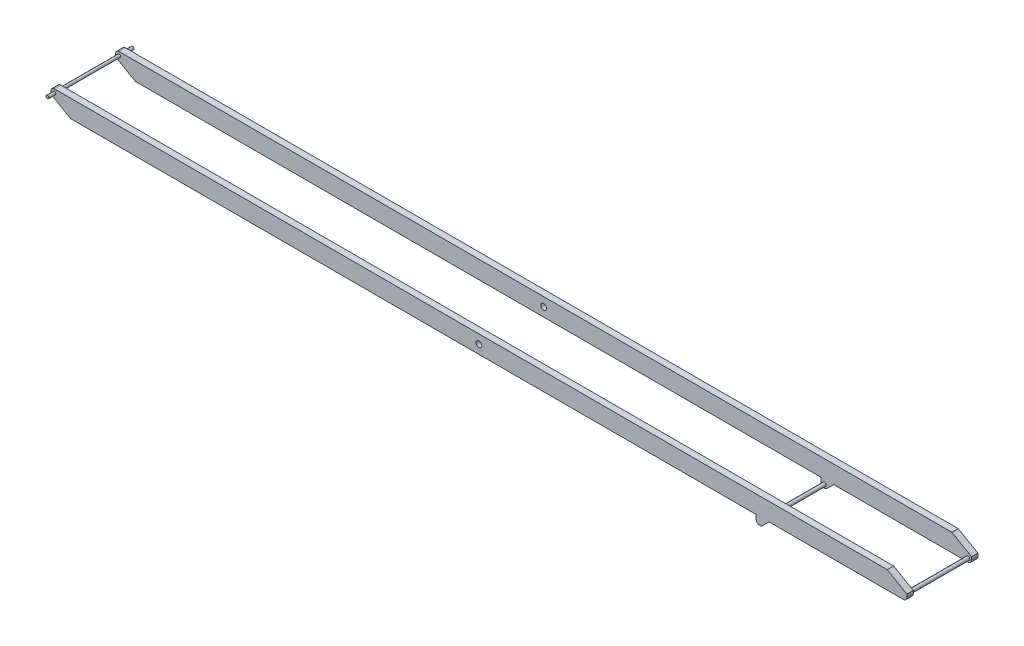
ISO-10303-21;
HEADER;
FILE_DESCRIPTION(('STEP AP214'),'2;1');
FILE_NAME('part.step','',(''),(''),'','','');
FILE_SCHEMA(('AUTOMOTIVE_DESIGN { 1 0 10303 214 1 1 1 1 }'));
ENDSEC;
DATA;
#1=APPLICATION_CONTEXT('core data for automotive mechanical design processes');
#2=APPLICATION_PROTOCOL_DEFINITION('international standard','automotive_design',2000,#1);
#3=PRODUCT_CONTEXT('',#1,'mechanical');
#4=PRODUCT('Part','Part','',(#3));
#5=PRODUCT_RELATED_PRODUCT_CATEGORY('part','',(#4));
#6=PRODUCT_DEFINITION_FORMATION('','',#4);
#7=PRODUCT_DEFINITION_CONTEXT('part definition',#1,'design');
#8=PRODUCT_DEFINITION('design','',#6,#7);
#9=PRODUCT_DEFINITION_SHAPE('','',#8);
#10=(LENGTH_UNIT() NAMED_UNIT(*) SI_UNIT(.MILLI.,.METRE.));
#11=(NAMED_UNIT(*) PLANE_ANGLE_UNIT() SI_UNIT($,.RADIAN.));
#12=(NAMED_UNIT(*) SI_UNIT($,.STERADIAN.) SOLID_ANGLE_UNIT());
#13=UNCERTAINTY_MEASURE_WITH_UNIT(LENGTH_MEASURE(1.E-05),#10,'distance_accuracy_value','');
#14=(GEOMETRIC_REPRESENTATION_CONTEXT(3) GLOBAL_UNCERTAINTY_ASSIGNED_CONTEXT((#13)) GLOBAL_UNIT_ASSIGNED_CONTEXT((#10,
#11,#12)) REPRESENTATION_CONTEXT('',''));
#15=CARTESIAN_POINT('',(0.,0.,0.));
#16=DIRECTION('',(0.,0.,1.));
#17=DIRECTION('',(1.,0.,0.));
#18=AXIS2_PLACEMENT_3D('',#15,#16,#17);
#19=CARTESIAN_POINT('',(0.,-50.,500.));
#20=DIRECTION('',(0.,1.,0.));
#21=DIRECTION('',(-1.,0.,0.));
#22=AXIS2_PLACEMENT_3D('',#19,#20,#21);
#23=PLANE('',#22);
#24=DIRECTION('',(1.,0.,0.));
#25=VECTOR('',#24,1.);
#26=CARTESIAN_POINT('',(0.,-50.,-500.));
#27=LINE('',#26,#25);
#28=CARTESIAN_POINT('',(-11722.871870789,-50.0000000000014,-500.));
#29=VERTEX_POINT('',#28);
#30=CARTESIAN_POINT('',(-2072.01013845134,-50.0000000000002,-500.));
#31=VERTEX_POINT('',#30);
#32=EDGE_CURVE('E55',#29,#31,#27,.T.);
#33=ORIENTED_EDGE('',*,*,#32,.T.);
#34=DIRECTION('',(0.,0.,-1.));
#35=VECTOR('',#34,1.);
#36=CARTESIAN_POINT('',(-2072.01013845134,-50.0000000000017,11645.376393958));
#37=LINE('',#36,#35);
#38=CARTESIAN_POINT('',(-2072.01013845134,-50.0000000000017,-410.));
#39=VERTEX_POINT('',#38);
#40=EDGE_CURVE('E230',#39,#31,#37,.T.);
#41=ORIENTED_EDGE('',*,*,#40,.F.);
#42=DIRECTION('',(-1.,0.,0.));
#43=VECTOR('',#42,1.);
#44=CARTESIAN_POINT('',(-13013.7618016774,-50.000000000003,-410.));
#45=LINE('',#44,#43);
#46=CARTESIAN_POINT('',(-11722.871870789,-50.0000000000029,-410.));
#47=VERTEX_POINT('',#46);
#48=EDGE_CURVE('E371',#39,#47,#45,.T.);
#49=ORIENTED_EDGE('',*,*,#48,.T.);
#50=DIRECTION('',(0.,0.,-1.));
#51=VECTOR('',#50,1.);
#52=CARTESIAN_POINT('',(-11722.871870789,-50.0000000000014,500.));
#53=LINE('',#52,#51);
#54=EDGE_CURVE('E399',#47,#29,#53,.T.);
#55=ORIENTED_EDGE('',*,*,#54,.T.);
#56=EDGE_LOOP('',(#33,#41,#49,#55));
#57=FACE_BOUND('',#56,.T.);
#58=ADVANCED_FACE('F31',(#57),#23,.F.);
#59=CARTESIAN_POINT('',(-2022.01013845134,-110.000000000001,500.));
#60=DIRECTION('',(0.,0.,-1.));
#61=DIRECTION('',(-1.,0.,0.));
#62=AXIS2_PLACEMENT_3D('',#59,#60,#61);
#63=CYLINDRICAL_SURFACE('',#62,25.);
#64=CARTESIAN_POINT('',(-2022.01013845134,-110.000000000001,410.));
#65=DIRECTION('',(0.,0.,1.));
#66=DIRECTION('',(1.,0.,0.));
#67=AXIS2_PLACEMENT_3D('',#64,#65,#66);
#68=CIRCLE('',#67,25.);
#69=CARTESIAN_POINT('',(-1997.01013845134,-110.000000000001,410.));
#70=VERTEX_POINT('',#69);
#71=EDGE_CURVE('E40',#70,#70,#68,.F.);
#72=ORIENTED_EDGE('',*,*,#71,.T.);
#73=EDGE_LOOP('',(#72));
#74=FACE_BOUND('',#73,.T.);
#75=CARTESIAN_POINT('',(-2022.01013845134,-110.000000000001,-410.));
#76=DIRECTION('',(0.,0.,-1.));
#77=DIRECTION('',(-1.,0.,0.));
#78=AXIS2_PLACEMENT_3D('',#75,#76,#77);
#79=CIRCLE('',#78,25.);
#80=CARTESIAN_POINT('',(-2047.01013845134,-110.000000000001,-410.));
#81=VERTEX_POINT('',#80);
#82=EDGE_CURVE('E11',#81,#81,#79,.T.);
#83=ORIENTED_EDGE('',*,*,#82,.F.);
#84=EDGE_LOOP('',(#83));
#85=FACE_BOUND('',#84,.T.);
#86=ADVANCED_FACE('F414',(#74,#85),#63,.T.);
#87=CARTESIAN_POINT('',(-13013.7618016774,-50.000000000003,410.));
#88=DIRECTION('',(0.,0.,1.));
#89=DIRECTION('',(1.,0.,0.));
#90=AXIS2_PLACEMENT_3D('',#87,#88,#89);
#91=PLANE('',#90);
#92=CARTESIAN_POINT('',(-5974.52927016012,74.9999999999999,410.));
#93=DIRECTION('',(0.,0.,1.));
#94=DIRECTION('',(1.,0.,0.));
#95=AXIS2_PLACEMENT_3D('',#92,#93,#94);
#96=CIRCLE('',#95,40.0000000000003);
#97=CARTESIAN_POINT('',(-5934.52927016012,74.9999999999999,410.));
#98=VERTEX_POINT('',#97);
#99=EDGE_CURVE('E220',#98,#98,#96,.T.);
#100=ORIENTED_EDGE('',*,*,#99,.T.);
#101=EDGE_LOOP('',(#100));
#102=FACE_BOUND('',#101,.T.);
#103=CARTESIAN_POINT('',(-11949.0585403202,149.999999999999,410.));
#104=DIRECTION('',(0.,0.,1.));
#105=DIRECTION('',(1.,0.,0.));
#106=AXIS2_PLACEMENT_3D('',#103,#104,#105);
#107=CIRCLE('',#106,19.9999999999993);
#108=CARTESIAN_POINT('',(-11929.0585403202,149.999999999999,410.));
#109=VERTEX_POINT('',#108);
#110=EDGE_CURVE('E396',#109,#109,#107,.T.);
#111=ORIENTED_EDGE('',*,*,#110,.T.);
#112=EDGE_LOOP('',(#111));
#113=FACE_BOUND('',#112,.T.);
#114=CARTESIAN_POINT('',(0.,0.,410.));
#115=DIRECTION('',(0.,0.,1.));
#116=DIRECTION('',(1.,0.,0.));
#117=AXIS2_PLACEMENT_3D('',#114,#115,#116);
#118=CIRCLE('',#117,25.);
#119=CARTESIAN_POINT('',(25.,0.,410.));
#120=VERTEX_POINT('',#119);
#121=EDGE_CURVE('E259',#120,#120,#118,.F.);
#122=ORIENTED_EDGE('',*,*,#121,.F.);
#123=EDGE_LOOP('',(#122));
#124=FACE_BOUND('',#123,.T.);
#125=DIRECTION('',(1.,0.,0.));
#126=VECTOR('',#125,1.);
#127=CARTESIAN_POINT('',(-13013.7618016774,-50.000000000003,410.));
#128=LINE('',#127,#126);
#129=CARTESIAN_POINT('',(-1890.59286257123,-50.0000000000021,410.));
#130=VERTEX_POINT('',#129);
#131=CARTESIAN_POINT('',(0.,-50.0000000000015,410.));
#132=VERTEX_POINT('',#131);
#133=EDGE_CURVE('E269',#130,#132,#128,.T.);
#134=ORIENTED_EDGE('',*,*,#133,.F.);
#135=DIRECTION('',(-0.709710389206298,-0.704493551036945,0.));
#136=VECTOR('',#135,1.);
#137=CARTESIAN_POINT('',(-1876.87589747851,-36.3838636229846,410.));
#138=LINE('',#137,#136);
#139=CARTESIAN_POINT('',(-1986.78546089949,-145.485519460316,410.));
#140=VERTEX_POINT('',#139);
#141=EDGE_CURVE('E240',#130,#140,#138,.T.);
#142=ORIENTED_EDGE('',*,*,#141,.T.);
#143=CARTESIAN_POINT('',(-2022.01013845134,-110.000000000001,410.));
#144=DIRECTION('',(0.,0.,1.));
#145=DIRECTION('',(1.,0.,0.));
#146=AXIS2_PLACEMENT_3D('',#143,#144,#145);
#147=CIRCLE('',#146,49.9999999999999);
#148=CARTESIAN_POINT('',(-2072.01013845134,-110.000000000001,410.));
#149=VERTEX_POINT('',#148);
#150=EDGE_CURVE('E237',#140,#149,#147,.F.);
#151=ORIENTED_EDGE('',*,*,#150,.T.);
#152=DIRECTION('',(0.,1.,0.));
#153=VECTOR('',#152,1.);
#154=CARTESIAN_POINT('',(-2072.01013845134,-110.000000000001,410.));
#155=LINE('',#154,#153);
#156=CARTESIAN_POINT('',(-2072.01013845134,-50.0000000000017,410.));
#157=VERTEX_POINT('',#156);
#158=EDGE_CURVE('E234',#149,#157,#155,.T.);
#159=ORIENTED_EDGE('',*,*,#158,.T.);
#160=CARTESIAN_POINT('',(-11722.871870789,-50.0000000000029,410.));
#161=VERTEX_POINT('',#160);
#162=EDGE_CURVE('E266',#161,#157,#128,.T.);
#163=ORIENTED_EDGE('',*,*,#162,.F.);
#164=DIRECTION('',(0.866025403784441,-0.499999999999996,0.));
#165=VECTOR('',#164,1.);
#166=CARTESIAN_POINT('',(-12000.,109.999999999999,410.));
#167=LINE('',#166,#165);
#168=CARTESIAN_POINT('',(-12000.,109.999999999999,410.));
#169=VERTEX_POINT('',#168);
#170=EDGE_CURVE('E279',#169,#161,#167,.T.);
#171=ORIENTED_EDGE('',*,*,#170,.F.);
#172=DIRECTION('',(0.,-1.,0.));
#173=VECTOR('',#172,1.);
#174=CARTESIAN_POINT('',(-12000.,149.999999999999,410.));
#175=LINE('',#174,#173);
#176=CARTESIAN_POINT('',(-12000.,149.999999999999,410.));
#177=VERTEX_POINT('',#176);
#178=EDGE_CURVE('E282',#177,#169,#175,.T.);
#179=ORIENTED_EDGE('',*,*,#178,.F.);
#180=CARTESIAN_POINT('',(-11950.,149.999999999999,410.));
#181=DIRECTION('',(0.,0.,1.));
#182=DIRECTION('',(1.,0.,0.));
#183=AXIS2_PLACEMENT_3D('',#180,#181,#182);
#184=CIRCLE('',#183,49.9999999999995);
#185=CARTESIAN_POINT('',(-11950.,199.999999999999,410.));
#186=VERTEX_POINT('',#185);
#187=EDGE_CURVE('E285',#186,#177,#184,.T.);
#188=ORIENTED_EDGE('',*,*,#187,.F.);
#189=DIRECTION('',(1.,0.,0.));
#190=VECTOR('',#189,1.);
#191=CARTESIAN_POINT('',(-13013.7618016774,199.999999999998,410.));
#192=LINE('',#191,#190);
#193=CARTESIAN_POINT('',(-227.128129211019,200.,410.));
#194=VERTEX_POINT('',#193);
#195=EDGE_CURVE('E265',#186,#194,#192,.T.);
#196=ORIENTED_EDGE('',*,*,#195,.T.);
#197=DIRECTION('',(-0.866025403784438,0.500000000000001,0.));
#198=VECTOR('',#197,1.);
#199=CARTESIAN_POINT('',(50.,40.,410.));
#200=LINE('',#199,#198);
#201=CARTESIAN_POINT('',(50.,40.,410.));
#202=VERTEX_POINT('',#201);
#203=EDGE_CURVE('E268',#202,#194,#200,.T.);
#204=ORIENTED_EDGE('',*,*,#203,.F.);
#205=DIRECTION('',(0.,1.,0.));
#206=VECTOR('',#205,1.);
#207=CARTESIAN_POINT('',(50.,0.,410.));
#208=LINE('',#207,#206);
#209=CARTESIAN_POINT('',(50.,0.,410.));
#210=VERTEX_POINT('',#209);
#211=EDGE_CURVE('E273',#210,#202,#208,.T.);
#212=ORIENTED_EDGE('',*,*,#211,.F.);
#213=CARTESIAN_POINT('',(0.,0.,410.));
#214=DIRECTION('',(0.,0.,1.));
#215=DIRECTION('',(1.,0.,0.));
#216=AXIS2_PLACEMENT_3D('',#213,#214,#215);
#217=CIRCLE('',#216,50.);
#218=EDGE_CURVE('E276',#132,#210,#217,.T.);
#219=ORIENTED_EDGE('',*,*,#218,.F.);
#220=EDGE_LOOP('',(#134,#142,#151,#159,#163,#171,#179,#188,#196,#204,#212,#219));
#221=FACE_BOUND('',#220,.T.);
#222=ORIENTED_EDGE('',*,*,#71,.F.);
#223=EDGE_LOOP('',(#222));
#224=FACE_BOUND('',#223,.T.);
#225=ADVANCED_FACE('F417',(#102,#113,#124,#221,#224),#91,.F.);
#226=CARTESIAN_POINT('',(0.,-50.,500.));
#227=DIRECTION('',(0.,1.,0.));
#228=DIRECTION('',(-1.,0.,0.));
#229=AXIS2_PLACEMENT_3D('',#226,#227,#228);
#230=PLANE('',#229);
#231=ORIENTED_EDGE('',*,*,#162,.T.);
#232=DIRECTION('',(0.,0.,1.));
#233=VECTOR('',#232,1.);
#234=CARTESIAN_POINT('',(-2072.01013845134,-50.0000000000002,500.));
#235=LINE('',#234,#233);
#236=CARTESIAN_POINT('',(-2072.01013845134,-50.0000000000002,500.));
#237=VERTEX_POINT('',#236);
#238=EDGE_CURVE('E257',#157,#237,#235,.T.);
#239=ORIENTED_EDGE('',*,*,#238,.T.);
#240=DIRECTION('',(1.,0.,0.));
#241=VECTOR('',#240,1.);
#242=CARTESIAN_POINT('',(0.,-50.,500.));
#243=LINE('',#242,#241);
#244=CARTESIAN_POINT('',(-11722.871870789,-50.0000000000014,500.));
#245=VERTEX_POINT('',#244);
#246=EDGE_CURVE('E299',#245,#237,#243,.T.);
#247=ORIENTED_EDGE('',*,*,#246,.F.);
#248=DIRECTION('',(0.,0.,-1.));
#249=VECTOR('',#248,1.);
#250=CARTESIAN_POINT('',(-11722.871870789,-50.0000000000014,500.));
#251=LINE('',#250,#249);
#252=EDGE_CURVE('E325',#245,#161,#251,.T.);
#253=ORIENTED_EDGE('',*,*,#252,.T.);
#254=EDGE_LOOP('',(#231,#239,#247,#253));
#255=FACE_BOUND('',#254,.T.);
#256=ADVANCED_FACE('F419',(#255),#230,.F.);
#257=CARTESIAN_POINT('',(-11949.0585403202,149.999999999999,600.));
#258=DIRECTION('',(0.,0.,-1.));
#259=DIRECTION('',(-1.,0.,0.));
#260=AXIS2_PLACEMENT_3D('',#257,#258,#259);
#261=CYLINDRICAL_SURFACE('',#260,19.9999999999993);
#262=CARTESIAN_POINT('',(-11949.0585403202,149.999999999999,-410.));
#263=DIRECTION('',(0.,0.,-1.));
#264=DIRECTION('',(-1.,0.,0.));
#265=AXIS2_PLACEMENT_3D('',#262,#263,#264);
#266=CIRCLE('',#265,19.9999999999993);
#267=CARTESIAN_POINT('',(-11969.0585403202,149.999999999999,-410.));
#268=VERTEX_POINT('',#267);
#269=EDGE_CURVE('E338',#268,#268,#266,.F.);
#270=ORIENTED_EDGE('',*,*,#269,.T.);
#271=EDGE_LOOP('',(#270));
#272=FACE_BOUND('',#271,.T.);
#273=ORIENTED_EDGE('',*,*,#110,.F.);
#274=EDGE_LOOP('',(#273));
#275=FACE_BOUND('',#274,.T.);
#276=ADVANCED_FACE('F426',(#272,#275),#261,.T.);
#277=CARTESIAN_POINT('',(-11950.,149.999999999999,500.));
#278=DIRECTION('',(0.,0.,-1.));
#279=DIRECTION('',(-1.,0.,0.));
#280=AXIS2_PLACEMENT_3D('',#277,#278,#279);
#281=CYLINDRICAL_SURFACE('',#280,49.9999999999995);
#282=DIRECTION('',(0.,0.,-1.));
#283=VECTOR('',#282,1.);
#284=CARTESIAN_POINT('',(-12000.,149.999999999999,500.));
#285=LINE('',#284,#283);
#286=CARTESIAN_POINT('',(-12000.,149.999999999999,-410.));
#287=VERTEX_POINT('',#286);
#288=CARTESIAN_POINT('',(-12000.,149.999999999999,-500.));
#289=VERTEX_POINT('',#288);
#290=EDGE_CURVE('E377',#287,#289,#285,.T.);
#291=ORIENTED_EDGE('',*,*,#290,.F.);
#292=CARTESIAN_POINT('',(-11950.,149.999999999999,-410.));
#293=DIRECTION('',(0.,0.,-1.));
#294=DIRECTION('',(-1.,0.,0.));
#295=AXIS2_PLACEMENT_3D('',#292,#293,#294);
#296=CIRCLE('',#295,49.9999999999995);
#297=CARTESIAN_POINT('',(-11950.,199.999999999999,-410.));
#298=VERTEX_POINT('',#297);
#299=EDGE_CURVE('E346',#287,#298,#296,.T.);
#300=ORIENTED_EDGE('',*,*,#299,.T.);
#301=DIRECTION('',(0.,0.,-1.));
#302=VECTOR('',#301,1.);
#303=CARTESIAN_POINT('',(-11950.,199.999999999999,500.));
#304=LINE('',#303,#302);
#305=CARTESIAN_POINT('',(-11950.,199.999999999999,-500.));
#306=VERTEX_POINT('',#305);
#307=EDGE_CURVE('E382',#298,#306,#304,.T.);
#308=ORIENTED_EDGE('',*,*,#307,.T.);
#309=CARTESIAN_POINT('',(-11950.,149.999999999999,-500.));
#310=DIRECTION('',(0.,0.,1.));
#311=DIRECTION('',(1.,0.,0.));
#312=AXIS2_PLACEMENT_3D('',#309,#310,#311);
#313=CIRCLE('',#312,49.9999999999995);
#314=EDGE_CURVE('E378',#306,#289,#313,.T.);
#315=ORIENTED_EDGE('',*,*,#314,.T.);
#316=EDGE_LOOP('',(#291,#300,#308,#315));
#317=FACE_BOUND('',#316,.T.);
#318=ADVANCED_FACE('F33',(#317),#281,.T.);
#319=CARTESIAN_POINT('',(-12000.,149.999999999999,500.));
#320=DIRECTION('',(1.,0.,0.));
#321=DIRECTION('',(0.,1.,0.));
#322=AXIS2_PLACEMENT_3D('',#319,#320,#321);
#323=PLANE('',#322);
#324=DIRECTION('',(0.,0.,-1.));
#325=VECTOR('',#324,1.);
#326=CARTESIAN_POINT('',(-12000.,109.999999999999,500.));
#327=LINE('',#326,#325);
#328=CARTESIAN_POINT('',(-12000.,109.999999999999,-410.));
#329=VERTEX_POINT('',#328);
#330=CARTESIAN_POINT('',(-12000.,109.999999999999,-500.));
#331=VERTEX_POINT('',#330);
#332=EDGE_CURVE('E372',#329,#331,#327,.T.);
#333=ORIENTED_EDGE('',*,*,#332,.F.);
#334=DIRECTION('',(0.,1.,0.));
#335=VECTOR('',#334,1.);
#336=CARTESIAN_POINT('',(-12000.,149.999999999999,-410.));
#337=LINE('',#336,#335);
#338=EDGE_CURVE('E381',#329,#287,#337,.T.);
#339=ORIENTED_EDGE('',*,*,#338,.T.);
#340=ORIENTED_EDGE('',*,*,#290,.T.);
#341=DIRECTION('',(0.,-1.,0.));
#342=VECTOR('',#341,1.);
#343=CARTESIAN_POINT('',(-12000.,149.999999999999,-500.));
#344=LINE('',#343,#342);
#345=EDGE_CURVE('E373',#289,#331,#344,.T.);
#346=ORIENTED_EDGE('',*,*,#345,.T.);
#347=EDGE_LOOP('',(#333,#339,#340,#346));
#348=FACE_BOUND('',#347,.T.);
#349=ADVANCED_FACE('F450',(#348),#323,.F.);
#350=CARTESIAN_POINT('',(-12000.,109.999999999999,500.));
#351=DIRECTION('',(0.499999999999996,0.866025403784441,0.));
#352=DIRECTION('',(-0.866025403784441,0.499999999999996,0.));
#353=AXIS2_PLACEMENT_3D('',#350,#351,#352);
#354=PLANE('',#353);
#355=ORIENTED_EDGE('',*,*,#54,.F.);
#356=DIRECTION('',(-0.866025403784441,0.499999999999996,0.));
#357=VECTOR('',#356,1.);
#358=CARTESIAN_POINT('',(-12000.,109.999999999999,-410.));
#359=LINE('',#358,#357);
#360=EDGE_CURVE('E376',#47,#329,#359,.T.);
#361=ORIENTED_EDGE('',*,*,#360,.T.);
#362=ORIENTED_EDGE('',*,*,#332,.T.);
#363=DIRECTION('',(0.866025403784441,-0.499999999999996,0.));
#364=VECTOR('',#363,1.);
#365=CARTESIAN_POINT('',(-12000.,109.999999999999,-500.));
#366=LINE('',#365,#364);
#367=EDGE_CURVE('E368',#331,#29,#366,.T.);
#368=ORIENTED_EDGE('',*,*,#367,.T.);
#369=EDGE_LOOP('',(#355,#361,#362,#368));
#370=FACE_BOUND('',#369,.T.);
#371=ADVANCED_FACE('F443',(#370),#354,.F.);
#372=CARTESIAN_POINT('',(0.,-50.0000000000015,-410.));
#373=VERTEX_POINT('',#372);
#374=CARTESIAN_POINT('',(-1890.59286257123,-50.0000000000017,-410.));
#375=VERTEX_POINT('',#374);
#376=EDGE_CURVE('E397',#373,#375,#45,.T.);
#377=ORIENTED_EDGE('',*,*,#376,.T.);
#378=DIRECTION('',(0.,0.,-1.));
#379=VECTOR('',#378,1.);
#380=CARTESIAN_POINT('',(-1890.59286257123,-50.0000000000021,11645.376393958));
#381=LINE('',#380,#379);
#382=CARTESIAN_POINT('',(-1890.59286257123,-50.0000000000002,-500.));
#383=VERTEX_POINT('',#382);
#384=EDGE_CURVE('E47',#375,#383,#381,.T.);
#385=ORIENTED_EDGE('',*,*,#384,.T.);
#386=CARTESIAN_POINT('',(0.,-50.,-500.));
#387=VERTEX_POINT('',#386);
#388=EDGE_CURVE('E219',#383,#387,#27,.T.);
#389=ORIENTED_EDGE('',*,*,#388,.T.);
#390=DIRECTION('',(0.,0.,-1.));
#391=VECTOR('',#390,1.);
#392=CARTESIAN_POINT('',(0.,-50.,500.));
#393=LINE('',#392,#391);
#394=EDGE_CURVE('E365',#373,#387,#393,.T.);
#395=ORIENTED_EDGE('',*,*,#394,.F.);
#396=EDGE_LOOP('',(#377,#385,#389,#395));
#397=FACE_BOUND('',#396,.T.);
#398=ADVANCED_FACE('F436',(#397),#23,.F.);
#399=CARTESIAN_POINT('',(0.,0.,500.));
#400=DIRECTION('',(0.,0.,-1.));
#401=DIRECTION('',(-1.,0.,0.));
#402=AXIS2_PLACEMENT_3D('',#399,#400,#401);
#403=CYLINDRICAL_SURFACE('',#402,50.);
#404=DIRECTION('',(0.,0.,-1.));
#405=VECTOR('',#404,1.);
#406=CARTESIAN_POINT('',(50.,0.,500.));
#407=LINE('',#406,#405);
#408=CARTESIAN_POINT('',(50.,0.,-410.));
#409=VERTEX_POINT('',#408);
#410=CARTESIAN_POINT('',(50.,0.,-500.));
#411=VERTEX_POINT('',#410);
#412=EDGE_CURVE('E360',#409,#411,#407,.T.);
#413=ORIENTED_EDGE('',*,*,#412,.F.);
#414=CARTESIAN_POINT('',(0.,0.,-410.));
#415=DIRECTION('',(0.,0.,-1.));
#416=DIRECTION('',(-1.,0.,0.));
#417=AXIS2_PLACEMENT_3D('',#414,#415,#416);
#418=CIRCLE('',#417,50.);
#419=EDGE_CURVE('E367',#409,#373,#418,.T.);
#420=ORIENTED_EDGE('',*,*,#419,.T.);
#421=ORIENTED_EDGE('',*,*,#394,.T.);
#422=CARTESIAN_POINT('',(0.,0.,-500.));
#423=DIRECTION('',(0.,0.,1.));
#424=DIRECTION('',(1.,0.,0.));
#425=AXIS2_PLACEMENT_3D('',#422,#423,#424);
#426=CIRCLE('',#425,50.);
#427=EDGE_CURVE('E361',#387,#411,#426,.T.);
#428=ORIENTED_EDGE('',*,*,#427,.T.);
#429=EDGE_LOOP('',(#413,#420,#421,#428));
#430=FACE_BOUND('',#429,.T.);
#431=ADVANCED_FACE('F442',(#430),#403,.T.);
#432=CARTESIAN_POINT('',(50.,0.,500.));
#433=DIRECTION('',(-1.,0.,0.));
#434=DIRECTION('',(0.,-1.,0.));
#435=AXIS2_PLACEMENT_3D('',#432,#433,#434);
#436=PLANE('',#435);
#437=DIRECTION('',(0.,0.,-1.));
#438=VECTOR('',#437,1.);
#439=CARTESIAN_POINT('',(50.,40.,500.));
#440=LINE('',#439,#438);
#441=CARTESIAN_POINT('',(50.,40.,-410.));
#442=VERTEX_POINT('',#441);
#443=CARTESIAN_POINT('',(50.,40.,-500.));
#444=VERTEX_POINT('',#443);
#445=EDGE_CURVE('E355',#442,#444,#440,.T.);
#446=ORIENTED_EDGE('',*,*,#445,.F.);
#447=DIRECTION('',(0.,-1.,0.));
#448=VECTOR('',#447,1.);
#449=CARTESIAN_POINT('',(50.,0.,-410.));
#450=LINE('',#449,#448);
#451=EDGE_CURVE('E364',#442,#409,#450,.T.);
#452=ORIENTED_EDGE('',*,*,#451,.T.);
#453=ORIENTED_EDGE('',*,*,#412,.T.);
#454=DIRECTION('',(0.,1.,0.));
#455=VECTOR('',#454,1.);
#456=CARTESIAN_POINT('',(50.,0.,-500.));
#457=LINE('',#456,#455);
#458=EDGE_CURVE('E356',#411,#444,#457,.T.);
#459=ORIENTED_EDGE('',*,*,#458,.T.);
#460=EDGE_LOOP('',(#446,#452,#453,#459));
#461=FACE_BOUND('',#460,.T.);
#462=ADVANCED_FACE('F448',(#461),#436,.F.);
#463=CARTESIAN_POINT('',(50.,40.,500.));
#464=DIRECTION('',(-0.500000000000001,-0.866025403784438,0.));
#465=DIRECTION('',(0.866025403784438,-0.500000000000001,0.));
#466=AXIS2_PLACEMENT_3D('',#463,#464,#465);
#467=PLANE('',#466);
#468=DIRECTION('',(0.,0.,-1.));
#469=VECTOR('',#468,1.);
#470=CARTESIAN_POINT('',(-227.12812921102,200.,500.));
#471=LINE('',#470,#469);
#472=CARTESIAN_POINT('',(-227.12812921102,200.,-410.));
#473=VERTEX_POINT('',#472);
#474=CARTESIAN_POINT('',(-227.12812921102,200.,-500.));
#475=VERTEX_POINT('',#474);
#476=EDGE_CURVE('E351',#473,#475,#471,.T.);
#477=ORIENTED_EDGE('',*,*,#476,.F.);
#478=DIRECTION('',(0.866025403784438,-0.500000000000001,0.));
#479=VECTOR('',#478,1.);
#480=CARTESIAN_POINT('',(50.,40.,-410.));
#481=LINE('',#480,#479);
#482=EDGE_CURVE('E359',#473,#442,#481,.T.);
#483=ORIENTED_EDGE('',*,*,#482,.T.);
#484=ORIENTED_EDGE('',*,*,#445,.T.);
#485=DIRECTION('',(-0.866025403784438,0.500000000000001,0.));
#486=VECTOR('',#485,1.);
#487=CARTESIAN_POINT('',(50.,40.,-500.));
#488=LINE('',#487,#486);
#489=EDGE_CURVE('E352',#444,#475,#488,.T.);
#490=ORIENTED_EDGE('',*,*,#489,.T.);
#491=EDGE_LOOP('',(#477,#483,#484,#490));
#492=FACE_BOUND('',#491,.T.);
#493=ADVANCED_FACE('F557',(#492),#467,.F.);
#494=CARTESIAN_POINT('',(-227.12812921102,200.,500.));
#495=DIRECTION('',(0.,-1.,0.));
#496=DIRECTION('',(1.,0.,0.));
#497=AXIS2_PLACEMENT_3D('',#494,#495,#496);
#498=PLANE('',#497);
#499=ORIENTED_EDGE('',*,*,#307,.F.);
#500=DIRECTION('',(-1.,0.,0.));
#501=VECTOR('',#500,1.);
#502=CARTESIAN_POINT('',(-13013.7618016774,199.999999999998,-410.));
#503=LINE('',#502,#501);
#504=EDGE_CURVE('E350',#473,#298,#503,.T.);
#505=ORIENTED_EDGE('',*,*,#504,.F.);
#506=ORIENTED_EDGE('',*,*,#476,.T.);
#507=DIRECTION('',(-1.,0.,0.));
#508=VECTOR('',#507,1.);
#509=CARTESIAN_POINT('',(-227.12812921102,200.,-500.));
#510=LINE('',#509,#508);
#511=EDGE_CURVE('E347',#475,#306,#510,.T.);
#512=ORIENTED_EDGE('',*,*,#511,.T.);
#513=EDGE_LOOP('',(#499,#505,#506,#512));
#514=FACE_BOUND('',#513,.T.);
#515=ADVANCED_FACE('F551',(#514),#498,.F.);
#516=CARTESIAN_POINT('',(-11950.,149.999999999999,-500.));
#517=DIRECTION('',(0.,0.,1.));
#518=DIRECTION('',(1.,0.,0.));
#519=AXIS2_PLACEMENT_3D('',#516,#517,#518);
#520=PLANE('',#519);
#521=CARTESIAN_POINT('',(-5974.52927016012,74.9999999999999,-500.));
#522=DIRECTION('',(0.,0.,1.));
#523=DIRECTION('',(1.,0.,0.));
#524=AXIS2_PLACEMENT_3D('',#521,#522,#523);
#525=CIRCLE('',#524,40.0000000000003);
#526=CARTESIAN_POINT('',(-5934.52927016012,74.9999999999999,-500.));
#527=VERTEX_POINT('',#526);
#528=EDGE_CURVE('E223',#527,#527,#525,.T.);
#529=ORIENTED_EDGE('',*,*,#528,.T.);
#530=EDGE_LOOP('',(#529));
#531=FACE_BOUND('',#530,.T.);
#532=ORIENTED_EDGE('',*,*,#314,.F.);
#533=ORIENTED_EDGE('',*,*,#511,.F.);
#534=ORIENTED_EDGE('',*,*,#489,.F.);
#535=ORIENTED_EDGE('',*,*,#458,.F.);
#536=ORIENTED_EDGE('',*,*,#427,.F.);
#537=ORIENTED_EDGE('',*,*,#388,.F.);
#538=DIRECTION('',(-0.709710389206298,-0.704493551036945,0.));
#539=VECTOR('',#538,1.);
#540=CARTESIAN_POINT('',(-1890.59286257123,-50.0000000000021,-500.));
#541=LINE('',#540,#539);
#542=CARTESIAN_POINT('',(-1986.78546089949,-145.485519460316,-500.));
#543=VERTEX_POINT('',#542);
#544=EDGE_CURVE('E199',#383,#543,#541,.T.);
#545=ORIENTED_EDGE('',*,*,#544,.T.);
#546=CARTESIAN_POINT('',(-2022.01013845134,-110.000000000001,-500.));
#547=DIRECTION('',(0.,0.,-1.));
#548=DIRECTION('',(-1.,0.,0.));
#549=AXIS2_PLACEMENT_3D('',#546,#547,#548);
#550=CIRCLE('',#549,49.9999999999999);
#551=CARTESIAN_POINT('',(-2072.01013845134,-110.000000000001,-500.));
#552=VERTEX_POINT('',#551);
#553=EDGE_CURVE('E207',#543,#552,#550,.T.);
#554=ORIENTED_EDGE('',*,*,#553,.T.);
#555=DIRECTION('',(0.,1.,0.));
#556=VECTOR('',#555,1.);
#557=CARTESIAN_POINT('',(-2072.01013845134,-110.000000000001,-500.));
#558=LINE('',#557,#556);
#559=EDGE_CURVE('E213',#552,#31,#558,.T.);
#560=ORIENTED_EDGE('',*,*,#559,.T.);
#561=ORIENTED_EDGE('',*,*,#32,.F.);
#562=ORIENTED_EDGE('',*,*,#367,.F.);
#563=ORIENTED_EDGE('',*,*,#345,.F.);
#564=EDGE_LOOP('',(#532,#533,#534,#535,#536,#537,#545,#554,#560,#561,#562,#563));
#565=FACE_BOUND('',#564,.T.);
#566=CARTESIAN_POINT('',(-11949.0585403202,149.999999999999,-500.));
#567=DIRECTION('',(0.,0.,1.));
#568=DIRECTION('',(1.,0.,0.));
#569=AXIS2_PLACEMENT_3D('',#566,#567,#568);
#570=CIRCLE('',#569,19.9999999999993);
#571=CARTESIAN_POINT('',(-11929.0585403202,149.999999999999,-500.));
#572=VERTEX_POINT('',#571);
#573=EDGE_CURVE('E343',#572,#572,#570,.F.);
#574=ORIENTED_EDGE('',*,*,#573,.F.);
#575=EDGE_LOOP('',(#574));
#576=FACE_BOUND('',#575,.T.);
#577=ADVANCED_FACE('F216',(#531,#565,#576),#520,.F.);
#578=CARTESIAN_POINT('',(-13013.7618016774,-50.000000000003,-410.));
#579=DIRECTION('',(0.,0.,-1.));
#580=DIRECTION('',(-1.,0.,0.));
#581=AXIS2_PLACEMENT_3D('',#578,#579,#580);
#582=PLANE('',#581);
#583=CARTESIAN_POINT('',(-5974.52927016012,74.9999999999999,-410.));
#584=DIRECTION('',(0.,0.,-1.));
#585=DIRECTION('',(-1.,0.,0.));
#586=AXIS2_PLACEMENT_3D('',#583,#584,#585);
#587=CIRCLE('',#586,40.0000000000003);
#588=CARTESIAN_POINT('',(-6014.52927016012,74.9999999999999,-410.));
#589=VERTEX_POINT('',#588);
#590=EDGE_CURVE('E461',#589,#589,#587,.T.);
#591=ORIENTED_EDGE('',*,*,#590,.T.);
#592=EDGE_LOOP('',(#591));
#593=FACE_BOUND('',#592,.T.);
#594=CARTESIAN_POINT('',(0.,0.,-410.));
#595=DIRECTION('',(0.,0.,-1.));
#596=DIRECTION('',(-1.,0.,0.));
#597=AXIS2_PLACEMENT_3D('',#594,#595,#596);
#598=CIRCLE('',#597,25.);
#599=CARTESIAN_POINT('',(-25.,0.,-410.));
#600=VERTEX_POINT('',#599);
#601=EDGE_CURVE('E262',#600,#600,#598,.F.);
#602=ORIENTED_EDGE('',*,*,#601,.F.);
#603=EDGE_LOOP('',(#602));
#604=FACE_BOUND('',#603,.T.);
#605=ORIENTED_EDGE('',*,*,#269,.F.);
#606=EDGE_LOOP('',(#605));
#607=FACE_BOUND('',#606,.T.);
#608=ORIENTED_EDGE('',*,*,#338,.F.);
#609=ORIENTED_EDGE('',*,*,#360,.F.);
#610=ORIENTED_EDGE('',*,*,#48,.F.);
#611=DIRECTION('',(0.,-1.,0.));
#612=VECTOR('',#611,1.);
#613=CARTESIAN_POINT('',(-2072.01013845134,-110.000000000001,-410.));
#614=LINE('',#613,#612);
#615=CARTESIAN_POINT('',(-2072.01013845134,-110.000000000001,-410.));
#616=VERTEX_POINT('',#615);
#617=EDGE_CURVE('E226',#39,#616,#614,.T.);
#618=ORIENTED_EDGE('',*,*,#617,.T.);
#619=CARTESIAN_POINT('',(-2022.01013845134,-110.000000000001,-410.));
#620=DIRECTION('',(0.,0.,-1.));
#621=DIRECTION('',(-1.,0.,0.));
#622=AXIS2_PLACEMENT_3D('',#619,#620,#621);
#623=CIRCLE('',#622,49.9999999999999);
#624=CARTESIAN_POINT('',(-1986.78546089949,-145.485519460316,-410.));
#625=VERTEX_POINT('',#624);
#626=EDGE_CURVE('E456',#616,#625,#623,.F.);
#627=ORIENTED_EDGE('',*,*,#626,.T.);
#628=DIRECTION('',(0.709710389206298,0.704493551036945,0.));
#629=VECTOR('',#628,1.);
#630=CARTESIAN_POINT('',(-1890.59286257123,-50.0000000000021,-410.));
#631=LINE('',#630,#629);
#632=EDGE_CURVE('E201',#625,#375,#631,.T.);
#633=ORIENTED_EDGE('',*,*,#632,.T.);
#634=ORIENTED_EDGE('',*,*,#376,.F.);
#635=ORIENTED_EDGE('',*,*,#419,.F.);
#636=ORIENTED_EDGE('',*,*,#451,.F.);
#637=ORIENTED_EDGE('',*,*,#482,.F.);
#638=ORIENTED_EDGE('',*,*,#504,.T.);
#639=ORIENTED_EDGE('',*,*,#299,.F.);
#640=EDGE_LOOP('',(#608,#609,#610,#618,#627,#633,#634,#635,#636,#637,#638,#639));
#641=FACE_BOUND('',#640,.T.);
#642=ORIENTED_EDGE('',*,*,#82,.T.);
#643=EDGE_LOOP('',(#642));
#644=FACE_BOUND('',#643,.T.);
#645=ADVANCED_FACE('F454',(#593,#604,#607,#641,#644),#582,.F.);
#646=CARTESIAN_POINT('',(-11949.0585403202,149.999999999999,-600.));
#647=DIRECTION('',(0.,0.,1.));
#648=DIRECTION('',(1.,0.,0.));
#649=AXIS2_PLACEMENT_3D('',#646,#647,#648);
#650=CIRCLE('',#649,19.9999999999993);
#651=CARTESIAN_POINT('',(-11929.0585403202,149.999999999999,-600.));
#652=VERTEX_POINT('',#651);
#653=EDGE_CURVE('E334',#652,#652,#650,.T.);
#654=ORIENTED_EDGE('',*,*,#653,.T.);
#655=EDGE_LOOP('',(#654));
#656=FACE_BOUND('',#655,.T.);
#657=ORIENTED_EDGE('',*,*,#573,.T.);
#658=EDGE_LOOP('',(#657));
#659=FACE_BOUND('',#658,.T.);
#660=ADVANCED_FACE('F544',(#656,#659),#261,.T.);
#661=CARTESIAN_POINT('',(-11949.0585403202,149.999999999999,-600.));
#662=DIRECTION('',(0.,0.,1.));
#663=DIRECTION('',(1.,0.,0.));
#664=AXIS2_PLACEMENT_3D('',#661,#662,#663);
#665=PLANE('',#664);
#666=ORIENTED_EDGE('',*,*,#653,.F.);
#667=EDGE_LOOP('',(#666));
#668=FACE_BOUND('',#667,.T.);
#669=ADVANCED_FACE('F541',(#668),#665,.F.);
#670=CARTESIAN_POINT('',(-227.12812921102,200.,500.));
#671=DIRECTION('',(0.,-1.,0.));
#672=DIRECTION('',(1.,0.,0.));
#673=AXIS2_PLACEMENT_3D('',#670,#671,#672);
#674=PLANE('',#673);
#675=DIRECTION('',(0.,0.,-1.));
#676=VECTOR('',#675,1.);
#677=CARTESIAN_POINT('',(-227.12812921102,200.,500.));
#678=LINE('',#677,#676);
#679=CARTESIAN_POINT('',(-227.12812921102,200.,500.));
#680=VERTEX_POINT('',#679);
#681=EDGE_CURVE('E313',#680,#194,#678,.T.);
#682=ORIENTED_EDGE('',*,*,#681,.T.);
#683=ORIENTED_EDGE('',*,*,#195,.F.);
#684=DIRECTION('',(0.,0.,-1.));
#685=VECTOR('',#684,1.);
#686=CARTESIAN_POINT('',(-11950.,199.999999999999,500.));
#687=LINE('',#686,#685);
#688=CARTESIAN_POINT('',(-11950.,199.999999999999,500.));
#689=VERTEX_POINT('',#688);
#690=EDGE_CURVE('E310',#689,#186,#687,.T.);
#691=ORIENTED_EDGE('',*,*,#690,.F.);
#692=DIRECTION('',(-1.,0.,0.));
#693=VECTOR('',#692,1.);
#694=CARTESIAN_POINT('',(-227.12812921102,200.,500.));
#695=LINE('',#694,#693);
#696=EDGE_CURVE('E308',#680,#689,#695,.T.);
#697=ORIENTED_EDGE('',*,*,#696,.F.);
#698=EDGE_LOOP('',(#682,#683,#691,#697));
#699=FACE_BOUND('',#698,.T.);
#700=ADVANCED_FACE('F516',(#699),#674,.F.);
#701=CARTESIAN_POINT('',(50.,40.,500.));
#702=DIRECTION('',(-0.500000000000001,-0.866025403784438,0.));
#703=DIRECTION('',(0.866025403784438,-0.500000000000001,0.));
#704=AXIS2_PLACEMENT_3D('',#701,#702,#703);
#705=PLANE('',#704);
#706=DIRECTION('',(0.,0.,-1.));
#707=VECTOR('',#706,1.);
#708=CARTESIAN_POINT('',(50.,40.,500.));
#709=LINE('',#708,#707);
#710=CARTESIAN_POINT('',(50.,40.,500.));
#711=VERTEX_POINT('',#710);
#712=EDGE_CURVE('E316',#711,#202,#709,.T.);
#713=ORIENTED_EDGE('',*,*,#712,.T.);
#714=ORIENTED_EDGE('',*,*,#203,.T.);
#715=ORIENTED_EDGE('',*,*,#681,.F.);
#716=DIRECTION('',(-0.866025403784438,0.500000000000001,0.));
#717=VECTOR('',#716,1.);
#718=CARTESIAN_POINT('',(50.,40.,500.));
#719=LINE('',#718,#717);
#720=EDGE_CURVE('E306',#711,#680,#719,.T.);
#721=ORIENTED_EDGE('',*,*,#720,.F.);
#722=EDGE_LOOP('',(#713,#714,#715,#721));
#723=FACE_BOUND('',#722,.T.);
#724=ADVANCED_FACE('F511',(#723),#705,.F.);
#725=CARTESIAN_POINT('',(50.,0.,500.));
#726=DIRECTION('',(-1.,0.,0.));
#727=DIRECTION('',(0.,-1.,0.));
#728=AXIS2_PLACEMENT_3D('',#725,#726,#727);
#729=PLANE('',#728);
#730=DIRECTION('',(0.,0.,-1.));
#731=VECTOR('',#730,1.);
#732=CARTESIAN_POINT('',(50.,0.,500.));
#733=LINE('',#732,#731);
#734=CARTESIAN_POINT('',(50.,0.,500.));
#735=VERTEX_POINT('',#734);
#736=EDGE_CURVE('E319',#735,#210,#733,.T.);
#737=ORIENTED_EDGE('',*,*,#736,.T.);
#738=ORIENTED_EDGE('',*,*,#211,.T.);
#739=ORIENTED_EDGE('',*,*,#712,.F.);
#740=DIRECTION('',(0.,1.,0.));
#741=VECTOR('',#740,1.);
#742=CARTESIAN_POINT('',(50.,0.,500.));
#743=LINE('',#742,#741);
#744=EDGE_CURVE('E304',#735,#711,#743,.T.);
#745=ORIENTED_EDGE('',*,*,#744,.F.);
#746=EDGE_LOOP('',(#737,#738,#739,#745));
#747=FACE_BOUND('',#746,.T.);
#748=ADVANCED_FACE('F509',(#747),#729,.F.);
#749=CARTESIAN_POINT('',(0.,0.,500.));
#750=DIRECTION('',(0.,0.,-1.));
#751=DIRECTION('',(-1.,0.,0.));
#752=AXIS2_PLACEMENT_3D('',#749,#750,#751);
#753=CYLINDRICAL_SURFACE('',#752,50.);
#754=DIRECTION('',(0.,0.,-1.));
#755=VECTOR('',#754,1.);
#756=CARTESIAN_POINT('',(0.,-50.,500.));
#757=LINE('',#756,#755);
#758=CARTESIAN_POINT('',(0.,-50.,500.));
#759=VERTEX_POINT('',#758);
#760=EDGE_CURVE('E322',#759,#132,#757,.T.);
#761=ORIENTED_EDGE('',*,*,#760,.T.);
#762=ORIENTED_EDGE('',*,*,#218,.T.);
#763=ORIENTED_EDGE('',*,*,#736,.F.);
#764=CARTESIAN_POINT('',(0.,0.,500.));
#765=DIRECTION('',(0.,0.,1.));
#766=DIRECTION('',(1.,0.,0.));
#767=AXIS2_PLACEMENT_3D('',#764,#765,#766);
#768=CIRCLE('',#767,50.);
#769=EDGE_CURVE('E302',#759,#735,#768,.T.);
#770=ORIENTED_EDGE('',*,*,#769,.F.);
#771=EDGE_LOOP('',(#761,#762,#763,#770));
#772=FACE_BOUND('',#771,.T.);
#773=ADVANCED_FACE('F503',(#772),#753,.T.);
#774=CARTESIAN_POINT('',(-1890.59286257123,-50.0000000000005,500.));
#775=VERTEX_POINT('',#774);
#776=EDGE_CURVE('E298',#775,#759,#243,.T.);
#777=ORIENTED_EDGE('',*,*,#776,.F.);
#778=DIRECTION('',(0.,0.,-1.));
#779=VECTOR('',#778,1.);
#780=CARTESIAN_POINT('',(-1890.59286257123,-50.0000000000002,500.));
#781=LINE('',#780,#779);
#782=EDGE_CURVE('E254',#775,#130,#781,.T.);
#783=ORIENTED_EDGE('',*,*,#782,.T.);
#784=ORIENTED_EDGE('',*,*,#133,.T.);
#785=ORIENTED_EDGE('',*,*,#760,.F.);
#786=EDGE_LOOP('',(#777,#783,#784,#785));
#787=FACE_BOUND('',#786,.T.);
#788=ADVANCED_FACE('F429',(#787),#230,.F.);
#789=CARTESIAN_POINT('',(-12000.,109.999999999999,500.));
#790=DIRECTION('',(0.499999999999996,0.866025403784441,0.));
#791=DIRECTION('',(-0.866025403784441,0.499999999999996,0.));
#792=AXIS2_PLACEMENT_3D('',#789,#790,#791);
#793=PLANE('',#792);
#794=DIRECTION('',(0.,0.,-1.));
#795=VECTOR('',#794,1.);
#796=CARTESIAN_POINT('',(-12000.,109.999999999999,500.));
#797=LINE('',#796,#795);
#798=CARTESIAN_POINT('',(-12000.,109.999999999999,500.));
#799=VERTEX_POINT('',#798);
#800=EDGE_CURVE('E328',#799,#169,#797,.T.);
#801=ORIENTED_EDGE('',*,*,#800,.T.);
#802=ORIENTED_EDGE('',*,*,#170,.T.);
#803=ORIENTED_EDGE('',*,*,#252,.F.);
#804=DIRECTION('',(0.866025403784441,-0.499999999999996,0.));
#805=VECTOR('',#804,1.);
#806=CARTESIAN_POINT('',(-12000.,109.999999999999,500.));
#807=LINE('',#806,#805);
#808=EDGE_CURVE('E296',#799,#245,#807,.T.);
#809=ORIENTED_EDGE('',*,*,#808,.F.);
#810=EDGE_LOOP('',(#801,#802,#803,#809));
#811=FACE_BOUND('',#810,.T.);
#812=ADVANCED_FACE('F524',(#811),#793,.F.);
#813=CARTESIAN_POINT('',(-12000.,149.999999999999,500.));
#814=DIRECTION('',(1.,0.,0.));
#815=DIRECTION('',(0.,1.,0.));
#816=AXIS2_PLACEMENT_3D('',#813,#814,#815);
#817=PLANE('',#816);
#818=DIRECTION('',(0.,0.,-1.));
#819=VECTOR('',#818,1.);
#820=CARTESIAN_POINT('',(-12000.,149.999999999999,500.));
#821=LINE('',#820,#819);
#822=CARTESIAN_POINT('',(-12000.,149.999999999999,500.));
#823=VERTEX_POINT('',#822);
#824=EDGE_CURVE('E331',#823,#177,#821,.T.);
#825=ORIENTED_EDGE('',*,*,#824,.T.);
#826=ORIENTED_EDGE('',*,*,#178,.T.);
#827=ORIENTED_EDGE('',*,*,#800,.F.);
#828=DIRECTION('',(0.,-1.,0.));
#829=VECTOR('',#828,1.);
#830=CARTESIAN_POINT('',(-12000.,149.999999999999,500.));
#831=LINE('',#830,#829);
#832=EDGE_CURVE('E294',#823,#799,#831,.T.);
#833=ORIENTED_EDGE('',*,*,#832,.F.);
#834=EDGE_LOOP('',(#825,#826,#827,#833));
#835=FACE_BOUND('',#834,.T.);
#836=ADVANCED_FACE('F522',(#835),#817,.F.);
#837=CARTESIAN_POINT('',(-11950.,149.999999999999,500.));
#838=DIRECTION('',(0.,0.,-1.));
#839=DIRECTION('',(-1.,0.,0.));
#840=AXIS2_PLACEMENT_3D('',#837,#838,#839);
#841=CYLINDRICAL_SURFACE('',#840,49.9999999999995);
#842=ORIENTED_EDGE('',*,*,#690,.T.);
#843=ORIENTED_EDGE('',*,*,#187,.T.);
#844=ORIENTED_EDGE('',*,*,#824,.F.);
#845=CARTESIAN_POINT('',(-11950.,149.999999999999,500.));
#846=DIRECTION('',(0.,0.,1.));
#847=DIRECTION('',(1.,0.,0.));
#848=AXIS2_PLACEMENT_3D('',#845,#846,#847);
#849=CIRCLE('',#848,49.9999999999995);
#850=EDGE_CURVE('E291',#689,#823,#849,.T.);
#851=ORIENTED_EDGE('',*,*,#850,.F.);
#852=EDGE_LOOP('',(#842,#843,#844,#851));
#853=FACE_BOUND('',#852,.T.);
#854=ADVANCED_FACE('F475',(#853),#841,.T.);
#855=CARTESIAN_POINT('',(-11950.,149.999999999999,500.));
#856=DIRECTION('',(0.,0.,1.));
#857=DIRECTION('',(1.,0.,0.));
#858=AXIS2_PLACEMENT_3D('',#855,#856,#857);
#859=PLANE('',#858);
#860=CARTESIAN_POINT('',(-5974.52927016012,74.9999999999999,500.));
#861=DIRECTION('',(0.,0.,1.));
#862=DIRECTION('',(1.,0.,0.));
#863=AXIS2_PLACEMENT_3D('',#860,#861,#862);
#864=CIRCLE('',#863,40.0000000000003);
#865=CARTESIAN_POINT('',(-5934.52927016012,74.9999999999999,500.));
#866=VERTEX_POINT('',#865);
#867=EDGE_CURVE('E35',#866,#866,#864,.T.);
#868=ORIENTED_EDGE('',*,*,#867,.F.);
#869=EDGE_LOOP('',(#868));
#870=FACE_BOUND('',#869,.T.);
#871=CARTESIAN_POINT('',(-11949.0585403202,149.999999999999,500.));
#872=DIRECTION('',(0.,0.,1.));
#873=DIRECTION('',(1.,0.,0.));
#874=AXIS2_PLACEMENT_3D('',#871,#872,#873);
#875=CIRCLE('',#874,19.9999999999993);
#876=CARTESIAN_POINT('',(-11929.0585403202,149.999999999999,500.));
#877=VERTEX_POINT('',#876);
#878=EDGE_CURVE('E288',#877,#877,#875,.T.);
#879=ORIENTED_EDGE('',*,*,#878,.F.);
#880=EDGE_LOOP('',(#879));
#881=FACE_BOUND('',#880,.T.);
#882=ORIENTED_EDGE('',*,*,#246,.T.);
#883=DIRECTION('',(0.,-1.,0.));
#884=VECTOR('',#883,1.);
#885=CARTESIAN_POINT('',(-2072.01013845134,-110.000000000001,500.));
#886=LINE('',#885,#884);
#887=CARTESIAN_POINT('',(-2072.01013845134,-110.000000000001,500.));
#888=VERTEX_POINT('',#887);
#889=EDGE_CURVE('E247',#237,#888,#886,.T.);
#890=ORIENTED_EDGE('',*,*,#889,.T.);
#891=CARTESIAN_POINT('',(-2022.01013845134,-110.000000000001,500.));
#892=DIRECTION('',(0.,0.,1.));
#893=DIRECTION('',(1.,0.,0.));
#894=AXIS2_PLACEMENT_3D('',#891,#892,#893);
#895=CIRCLE('',#894,49.9999999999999);
#896=CARTESIAN_POINT('',(-1986.78546089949,-145.485519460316,500.));
#897=VERTEX_POINT('',#896);
#898=EDGE_CURVE('E241',#888,#897,#895,.T.);
#899=ORIENTED_EDGE('',*,*,#898,.T.);
#900=DIRECTION('',(0.709710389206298,0.704493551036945,0.));
#901=VECTOR('',#900,1.);
#902=CARTESIAN_POINT('',(-1876.87589747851,-36.3838636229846,500.));
#903=LINE('',#902,#901);
#904=EDGE_CURVE('E244',#897,#775,#903,.T.);
#905=ORIENTED_EDGE('',*,*,#904,.T.);
#906=ORIENTED_EDGE('',*,*,#776,.T.);
#907=ORIENTED_EDGE('',*,*,#769,.T.);
#908=ORIENTED_EDGE('',*,*,#744,.T.);
#909=ORIENTED_EDGE('',*,*,#720,.T.);
#910=ORIENTED_EDGE('',*,*,#696,.T.);
#911=ORIENTED_EDGE('',*,*,#850,.T.);
#912=ORIENTED_EDGE('',*,*,#832,.T.);
#913=ORIENTED_EDGE('',*,*,#808,.T.);
#914=EDGE_LOOP('',(#882,#890,#899,#905,#906,#907,#908,#909,#910,#911,#912,#913));
#915=FACE_BOUND('',#914,.T.);
#916=ADVANCED_FACE('F471',(#870,#881,#915),#859,.T.);
#917=CARTESIAN_POINT('',(-11949.0585403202,149.999999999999,600.));
#918=DIRECTION('',(0.,0.,1.));
#919=DIRECTION('',(1.,0.,0.));
#920=AXIS2_PLACEMENT_3D('',#917,#918,#919);
#921=PLANE('',#920);
#922=CARTESIAN_POINT('',(-11949.0585403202,149.999999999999,600.));
#923=DIRECTION('',(0.,0.,1.));
#924=DIRECTION('',(1.,0.,0.));
#925=AXIS2_PLACEMENT_3D('',#922,#923,#924);
#926=CIRCLE('',#925,19.9999999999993);
#927=CARTESIAN_POINT('',(-11929.0585403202,149.999999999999,600.));
#928=VERTEX_POINT('',#927);
#929=EDGE_CURVE('E335',#928,#928,#926,.T.);
#930=ORIENTED_EDGE('',*,*,#929,.T.);
#931=EDGE_LOOP('',(#930));
#932=FACE_BOUND('',#931,.T.);
#933=ADVANCED_FACE('F474',(#932),#921,.T.);
#934=ORIENTED_EDGE('',*,*,#878,.T.);
#935=EDGE_LOOP('',(#934));
#936=FACE_BOUND('',#935,.T.);
#937=ORIENTED_EDGE('',*,*,#929,.F.);
#938=EDGE_LOOP('',(#937));
#939=FACE_BOUND('',#938,.T.);
#940=ADVANCED_FACE('F539',(#936,#939),#261,.T.);
#941=CARTESIAN_POINT('',(0.,0.,500.));
#942=DIRECTION('',(0.,0.,-1.));
#943=DIRECTION('',(-1.,0.,0.));
#944=AXIS2_PLACEMENT_3D('',#941,#942,#943);
#945=CYLINDRICAL_SURFACE('',#944,25.);
#946=ORIENTED_EDGE('',*,*,#121,.T.);
#947=EDGE_LOOP('',(#946));
#948=FACE_BOUND('',#947,.T.);
#949=ORIENTED_EDGE('',*,*,#601,.T.);
#950=EDGE_LOOP('',(#949));
#951=FACE_BOUND('',#950,.T.);
#952=ADVANCED_FACE('F599',(#948,#951),#945,.T.);
#953=CARTESIAN_POINT('',(-2072.01013845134,-110.000000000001,179.0057984));
#954=DIRECTION('',(-1.,0.,0.));
#955=DIRECTION('',(0.,0.,1.));
#956=AXIS2_PLACEMENT_3D('',#953,#954,#955);
#957=PLANE('',#956);
#958=ORIENTED_EDGE('',*,*,#238,.F.);
#959=ORIENTED_EDGE('',*,*,#158,.F.);
#960=DIRECTION('',(0.,0.,1.));
#961=VECTOR('',#960,1.);
#962=CARTESIAN_POINT('',(-2072.01013845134,-110.000000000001,179.0057984));
#963=LINE('',#962,#961);
#964=EDGE_CURVE('E238',#149,#888,#963,.T.);
#965=ORIENTED_EDGE('',*,*,#964,.T.);
#966=ORIENTED_EDGE('',*,*,#889,.F.);
#967=EDGE_LOOP('',(#958,#959,#965,#966));
#968=FACE_BOUND('',#967,.T.);
#969=ADVANCED_FACE('F484',(#968),#957,.T.);
#970=CARTESIAN_POINT('',(-1876.87589747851,-36.3838636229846,179.0057984));
#971=DIRECTION('',(0.704493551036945,-0.709710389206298,0.));
#972=DIRECTION('',(0.709710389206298,0.704493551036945,0.));
#973=AXIS2_PLACEMENT_3D('',#970,#971,#972);
#974=PLANE('',#973);
#975=ORIENTED_EDGE('',*,*,#782,.F.);
#976=ORIENTED_EDGE('',*,*,#904,.F.);
#977=DIRECTION('',(0.,0.,1.));
#978=VECTOR('',#977,1.);
#979=CARTESIAN_POINT('',(-1986.78546089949,-145.485519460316,179.0057984));
#980=LINE('',#979,#978);
#981=EDGE_CURVE('E249',#140,#897,#980,.T.);
#982=ORIENTED_EDGE('',*,*,#981,.F.);
#983=ORIENTED_EDGE('',*,*,#141,.F.);
#984=EDGE_LOOP('',(#975,#976,#982,#983));
#985=FACE_BOUND('',#984,.T.);
#986=ADVANCED_FACE('F496',(#985),#974,.T.);
#987=CARTESIAN_POINT('',(-2022.01013845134,-110.000000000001,179.0057984));
#988=DIRECTION('',(0.,0.,1.));
#989=DIRECTION('',(1.,0.,0.));
#990=AXIS2_PLACEMENT_3D('',#987,#988,#989);
#991=CYLINDRICAL_SURFACE('',#990,49.9999999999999);
#992=ORIENTED_EDGE('',*,*,#150,.F.);
#993=ORIENTED_EDGE('',*,*,#981,.T.);
#994=ORIENTED_EDGE('',*,*,#898,.F.);
#995=ORIENTED_EDGE('',*,*,#964,.F.);
#996=EDGE_LOOP('',(#992,#993,#994,#995));
#997=FACE_BOUND('',#996,.T.);
#998=ADVANCED_FACE('F490',(#997),#991,.T.);
#999=CARTESIAN_POINT('',(-2072.01013845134,-110.000000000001,11645.376393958));
#1000=DIRECTION('',(-1.,0.,0.));
#1001=DIRECTION('',(0.,-1.,0.));
#1002=AXIS2_PLACEMENT_3D('',#999,#1000,#1001);
#1003=PLANE('',#1002);
#1004=ORIENTED_EDGE('',*,*,#617,.F.);
#1005=ORIENTED_EDGE('',*,*,#40,.T.);
#1006=ORIENTED_EDGE('',*,*,#559,.F.);
#1007=DIRECTION('',(0.,0.,-1.));
#1008=VECTOR('',#1007,1.);
#1009=CARTESIAN_POINT('',(-2072.01013845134,-110.000000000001,11645.376393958));
#1010=LINE('',#1009,#1008);
#1011=EDGE_CURVE('E204',#616,#552,#1010,.T.);
#1012=ORIENTED_EDGE('',*,*,#1011,.F.);
#1013=EDGE_LOOP('',(#1004,#1005,#1006,#1012));
#1014=FACE_BOUND('',#1013,.T.);
#1015=ADVANCED_FACE('F584',(#1014),#1003,.T.);
#1016=CARTESIAN_POINT('',(-2022.01013845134,-110.000000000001,11645.376393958));
#1017=DIRECTION('',(0.,0.,-1.));
#1018=DIRECTION('',(-1.,0.,0.));
#1019=AXIS2_PLACEMENT_3D('',#1016,#1017,#1018);
#1020=CYLINDRICAL_SURFACE('',#1019,49.9999999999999);
#1021=ORIENTED_EDGE('',*,*,#626,.F.);
#1022=ORIENTED_EDGE('',*,*,#1011,.T.);
#1023=ORIENTED_EDGE('',*,*,#553,.F.);
#1024=DIRECTION('',(0.,0.,-1.));
#1025=VECTOR('',#1024,1.);
#1026=CARTESIAN_POINT('',(-1986.78546089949,-145.485519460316,11645.376393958));
#1027=LINE('',#1026,#1025);
#1028=EDGE_CURVE('E195',#625,#543,#1027,.T.);
#1029=ORIENTED_EDGE('',*,*,#1028,.F.);
#1030=EDGE_LOOP('',(#1021,#1022,#1023,#1029));
#1031=FACE_BOUND('',#1030,.T.);
#1032=ADVANCED_FACE('F208',(#1031),#1020,.T.);
#1033=CARTESIAN_POINT('',(-1890.59286257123,-50.0000000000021,11645.376393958));
#1034=DIRECTION('',(0.704493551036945,-0.709710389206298,0.));
#1035=DIRECTION('',(0.709710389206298,0.704493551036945,0.));
#1036=AXIS2_PLACEMENT_3D('',#1033,#1034,#1035);
#1037=PLANE('',#1036);
#1038=ORIENTED_EDGE('',*,*,#632,.F.);
#1039=ORIENTED_EDGE('',*,*,#1028,.T.);
#1040=ORIENTED_EDGE('',*,*,#544,.F.);
#1041=ORIENTED_EDGE('',*,*,#384,.F.);
#1042=EDGE_LOOP('',(#1038,#1039,#1040,#1041));
#1043=FACE_BOUND('',#1042,.T.);
#1044=ADVANCED_FACE('F197',(#1043),#1037,.T.);
#1045=CARTESIAN_POINT('',(-5974.52927016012,74.9999999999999,-600.));
#1046=DIRECTION('',(0.,0.,1.));
#1047=DIRECTION('',(1.,0.,0.));
#1048=AXIS2_PLACEMENT_3D('',#1045,#1046,#1047);
#1049=CYLINDRICAL_SURFACE('',#1048,40.0000000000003);
#1050=ORIENTED_EDGE('',*,*,#867,.T.);
#1051=EDGE_LOOP('',(#1050));
#1052=FACE_BOUND('',#1051,.T.);
#1053=ORIENTED_EDGE('',*,*,#99,.F.);
#1054=EDGE_LOOP('',(#1053));
#1055=FACE_BOUND('',#1054,.T.);
#1056=ADVANCED_FACE('F468',(#1052,#1055),#1049,.F.);
#1057=ORIENTED_EDGE('',*,*,#590,.F.);
#1058=EDGE_LOOP('',(#1057));
#1059=FACE_BOUND('',#1058,.T.);
#1060=ORIENTED_EDGE('',*,*,#528,.F.);
#1061=EDGE_LOOP('',(#1060));
#1062=FACE_BOUND('',#1061,.T.);
#1063=ADVANCED_FACE('F829',(#1059,#1062),#1049,.F.);
#1064=CLOSED_SHELL('',(#58,#86,#225,#256,#276,#318,#349,#371,#398,#431,#462,#493,#515,#577,#645,
#660,#669,#700,#724,#748,#773,#788,#812,#836,#854,#916,#933,#940,#952,#969,#986,#998,#1015,
#1032,#1044,#1056,#1063));
#1065=MANIFOLD_SOLID_BREP('B2',#1064);
#1066=ADVANCED_BREP_SHAPE_REPRESENTATION('',(#18,#1065),#14);
#1067=SHAPE_DEFINITION_REPRESENTATION(#9,#1066);
ENDSEC;
END-ISO-10303-21;
